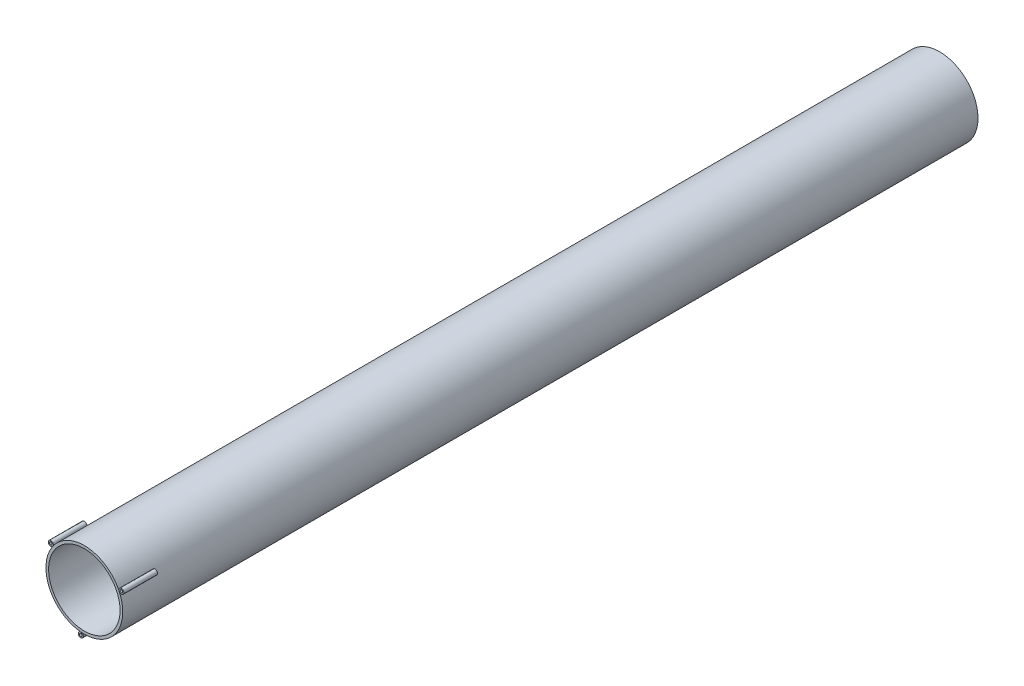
from build123d import *

# Parameters (mm, degrees)
SKETCH1_R        = 29.083
SKETCH1_R_2      = 27.051
EXTRUDE2_DEPTH   = 647.7
SKETCH6_R        = 1.905
SKETCH6_R_2      = 1.016
EXTRUDE3_DEPTH   = 25.4
EXTRUDE3_2_DEPTH = 25.4
EXTRUDE3_3_DEPTH = 25.4


with BuildPart() as part:
    # Sketch1 → Extrude2 (new body)
    with BuildSketch(Plane.XY):
        Circle(SKETCH1_R)
        Circle(SKETCH1_R_2, mode=Mode.SUBTRACT)
    extrude(amount=EXTRUDE2_DEPTH)


with BuildPart() as body_2:
    # Sketch6 → Extrude3 (new body)
    with BuildSketch(Plane.XY.offset(647.7)):
        with Locations((-2.684638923, -30.871489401)):
            Circle(SKETCH6_R)
        with Locations((-2.684638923, -30.871489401)):
            Circle(SKETCH6_R_2, mode=Mode.SUBTRACT)
    extrude(amount=-EXTRUDE3_DEPTH)


with BuildPart() as body_3:
    # Sketch6 → Extrude3 2 (new body)
    with BuildSketch(Plane.XY.offset(647.7)):
        with Locations((28.077813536, 13.110779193)):
            Circle(SKETCH6_R)
        with Locations((28.077813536, 13.110779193)):
            Circle(SKETCH6_R_2, mode=Mode.SUBTRACT)
    extrude(amount=-EXTRUDE3_2_DEPTH)


with BuildPart() as body_4:
    # Sketch6 → Extrude3 3 (new body)
    with BuildSketch(Plane.XY.offset(647.7)):
        with Locations((-25.393174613, 17.760710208)):
            Circle(SKETCH6_R)
        with Locations((-25.393174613, 17.760710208)):
            Circle(SKETCH6_R_2, mode=Mode.SUBTRACT)
    extrude(amount=-EXTRUDE3_3_DEPTH)


solid = Compound([part.part, body_2.part, body_3.part, body_4.part])
